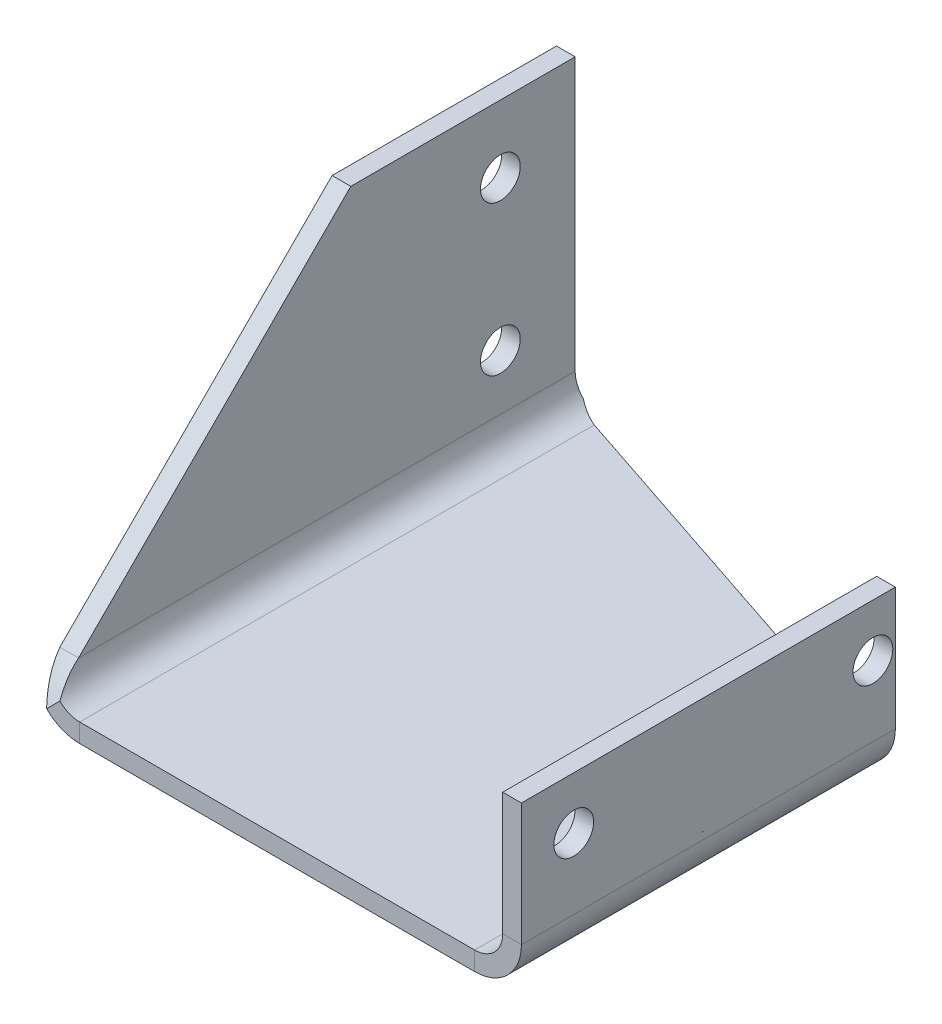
ISO-10303-21;
HEADER;
FILE_DESCRIPTION(('STEP AP214'),'2;1');
FILE_NAME('part.step','',(''),(''),'','','');
FILE_SCHEMA(('AUTOMOTIVE_DESIGN { 1 0 10303 214 1 1 1 1 }'));
ENDSEC;
DATA;
#1=APPLICATION_CONTEXT('core data for automotive mechanical design processes');
#2=APPLICATION_PROTOCOL_DEFINITION('international standard','automotive_design',2000,#1);
#3=PRODUCT_CONTEXT('',#1,'mechanical');
#4=PRODUCT('Part','Part','',(#3));
#5=PRODUCT_RELATED_PRODUCT_CATEGORY('part','',(#4));
#6=PRODUCT_DEFINITION_FORMATION('','',#4);
#7=PRODUCT_DEFINITION_CONTEXT('part definition',#1,'design');
#8=PRODUCT_DEFINITION('design','',#6,#7);
#9=PRODUCT_DEFINITION_SHAPE('','',#8);
#10=(LENGTH_UNIT() NAMED_UNIT(*) SI_UNIT(.MILLI.,.METRE.));
#11=(NAMED_UNIT(*) PLANE_ANGLE_UNIT() SI_UNIT($,.RADIAN.));
#12=(NAMED_UNIT(*) SI_UNIT($,.STERADIAN.) SOLID_ANGLE_UNIT());
#13=UNCERTAINTY_MEASURE_WITH_UNIT(LENGTH_MEASURE(1.E-05),#10,'distance_accuracy_value','');
#14=(GEOMETRIC_REPRESENTATION_CONTEXT(3) GLOBAL_UNCERTAINTY_ASSIGNED_CONTEXT((#13)) GLOBAL_UNIT_ASSIGNED_CONTEXT((#10,
#11,#12)) REPRESENTATION_CONTEXT('',''));
#15=CARTESIAN_POINT('',(0.,0.,0.));
#16=DIRECTION('',(0.,0.,1.));
#17=DIRECTION('',(1.,0.,0.));
#18=AXIS2_PLACEMENT_3D('',#15,#16,#17);
#19=CARTESIAN_POINT('',(47.4258596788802,50.99914032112,0.));
#20=DIRECTION('',(1.,0.,0.));
#21=DIRECTION('',(0.,0.,1.));
#22=AXIS2_PLACEMENT_3D('',#19,#20,#21);
#23=PLANE('',#22);
#24=CARTESIAN_POINT('',(47.4258596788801,14.16914032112,12.7));
#25=DIRECTION('',(-1.,0.,0.));
#26=DIRECTION('',(0.,0.,1.));
#27=AXIS2_PLACEMENT_3D('',#24,#25,#26);
#28=CIRCLE('',#27,3.37819999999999);
#29=CARTESIAN_POINT('',(47.4258596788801,14.16914032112,16.0782));
#30=VERTEX_POINT('',#29);
#31=EDGE_CURVE('E569',#30,#30,#28,.T.);
#32=ORIENTED_EDGE('',*,*,#31,.F.);
#33=EDGE_LOOP('',(#32));
#34=FACE_BOUND('',#33,.T.);
#35=DIRECTION('',(0.,0.,-1.));
#36=VECTOR('',#35,1.);
#37=CARTESIAN_POINT('',(47.42585967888,4.76250000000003,0.));
#38=LINE('',#37,#36);
#39=CARTESIAN_POINT('',(47.4258596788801,4.76250000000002,84.33664032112));
#40=VERTEX_POINT('',#39);
#41=CARTESIAN_POINT('',(47.42585967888,4.76250000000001,0.));
#42=VERTEX_POINT('',#41);
#43=EDGE_CURVE('E357',#40,#42,#38,.T.);
#44=ORIENTED_EDGE('',*,*,#43,.F.);
#45=DIRECTION('',(0.,-0.707106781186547,0.707106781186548));
#46=VECTOR('',#45,1.);
#47=CARTESIAN_POINT('',(47.4258596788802,50.99914032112,38.1));
#48=LINE('',#47,#46);
#49=CARTESIAN_POINT('',(47.4258596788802,50.99914032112,38.1));
#50=VERTEX_POINT('',#49);
#51=EDGE_CURVE('E353',#50,#40,#48,.T.);
#52=ORIENTED_EDGE('',*,*,#51,.F.);
#53=DIRECTION('',(0.,0.,1.));
#54=VECTOR('',#53,1.);
#55=CARTESIAN_POINT('',(47.4258596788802,50.99914032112,0.));
#56=LINE('',#55,#54);
#57=CARTESIAN_POINT('',(47.4258596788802,50.99914032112,0.));
#58=VERTEX_POINT('',#57);
#59=EDGE_CURVE('E354',#58,#50,#56,.T.);
#60=ORIENTED_EDGE('',*,*,#59,.F.);
#61=DIRECTION('',(0.,1.,0.));
#62=VECTOR('',#61,1.);
#63=CARTESIAN_POINT('',(47.42585967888,0.199140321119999,0.));
#64=LINE('',#63,#62);
#65=EDGE_CURVE('E341',#42,#58,#64,.T.);
#66=ORIENTED_EDGE('',*,*,#65,.F.);
#67=EDGE_LOOP('',(#44,#52,#60,#66));
#68=FACE_BOUND('',#67,.T.);
#69=CARTESIAN_POINT('',(47.4258596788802,39.56914032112,12.7));
#70=DIRECTION('',(-1.,0.,0.));
#71=DIRECTION('',(0.,0.,1.));
#72=AXIS2_PLACEMENT_3D('',#69,#70,#71);
#73=CIRCLE('',#72,3.37819999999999);
#74=CARTESIAN_POINT('',(47.4258596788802,39.56914032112,16.0782));
#75=VERTEX_POINT('',#74);
#76=EDGE_CURVE('E575',#75,#75,#73,.T.);
#77=ORIENTED_EDGE('',*,*,#76,.F.);
#78=EDGE_LOOP('',(#77));
#79=FACE_BOUND('',#78,.T.);
#80=ADVANCED_FACE('F73',(#34,#68,#79),#23,.F.);
#81=CARTESIAN_POINT('',(50.8,-3.175,0.));
#82=DIRECTION('',(0.316227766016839,0.,-0.948683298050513));
#83=DIRECTION('',(-0.948683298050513,0.,-0.316227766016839));
#84=AXIS2_PLACEMENT_3D('',#81,#82,#83);
#85=PLANE('',#84);
#86=DIRECTION('',(-0.948683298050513,0.,-0.316227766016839));
#87=VECTOR('',#86,1.);
#88=CARTESIAN_POINT('',(50.8,0.,0.));
#89=LINE('',#88,#87);
#90=CARTESIAN_POINT('',(122.43664032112,0.,23.8788801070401));
#91=VERTEX_POINT('',#90);
#92=CARTESIAN_POINT('',(55.36335967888,0.,1.52111989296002));
#93=VERTEX_POINT('',#92);
#94=EDGE_CURVE('E98',#91,#93,#89,.T.);
#95=ORIENTED_EDGE('',*,*,#94,.F.);
#96=CARTESIAN_POINT('',(122.43664032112,-3.175,23.8788801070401));
#97=CARTESIAN_POINT('',(122.43664032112,0.,23.8788801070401));
#98=B_SPLINE_CURVE_WITH_KNOTS('',1,(#96,#97),.UNSPECIFIED.,.F.,.F.,(2,2),(0.,1.),.UNSPECIFIED.);
#99=CARTESIAN_POINT('',(122.43664032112,-3.175,23.8788801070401));
#100=VERTEX_POINT('',#99);
#101=EDGE_CURVE('E328',#91,#100,#98,.F.);
#102=ORIENTED_EDGE('',*,*,#101,.T.);
#103=DIRECTION('',(-0.948683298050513,0.,-0.316227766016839));
#104=VECTOR('',#103,1.);
#105=CARTESIAN_POINT('',(50.8,-3.175,0.));
#106=LINE('',#105,#104);
#107=CARTESIAN_POINT('',(55.36335967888,-3.175,1.52111989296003));
#108=VERTEX_POINT('',#107);
#109=EDGE_CURVE('E501',#100,#108,#106,.T.);
#110=ORIENTED_EDGE('',*,*,#109,.T.);
#111=CARTESIAN_POINT('',(55.36335967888,0.,1.52111989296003));
#112=CARTESIAN_POINT('',(55.36335967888,-3.175,1.52111989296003));
#113=B_SPLINE_CURVE_WITH_KNOTS('',1,(#111,#112),.UNSPECIFIED.,.F.,.F.,(2,2),(0.,1.),.UNSPECIFIED.);
#114=EDGE_CURVE('E683',#93,#108,#113,.T.);
#115=ORIENTED_EDGE('',*,*,#114,.F.);
#116=EDGE_LOOP('',(#95,#102,#110,#115));
#117=FACE_BOUND('',#116,.T.);
#118=ADVANCED_FACE('F559',(#117),#85,.T.);
#119=CARTESIAN_POINT('',(152.4,-3.175,88.9));
#120=DIRECTION('',(0.,0.,1.));
#121=DIRECTION('',(1.,0.,0.));
#122=AXIS2_PLACEMENT_3D('',#119,#120,#121);
#123=PLANE('',#122);
#124=DIRECTION('',(1.,0.,0.));
#125=VECTOR('',#124,1.);
#126=CARTESIAN_POINT('',(50.8,-3.175,88.9));
#127=LINE('',#126,#125);
#128=CARTESIAN_POINT('',(55.36335967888,-3.175,88.9));
#129=VERTEX_POINT('',#128);
#130=CARTESIAN_POINT('',(122.43664032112,-3.17500000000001,88.9));
#131=VERTEX_POINT('',#130);
#132=EDGE_CURVE('E507',#129,#131,#127,.T.);
#133=ORIENTED_EDGE('',*,*,#132,.T.);
#134=DIRECTION('',(0.,1.,0.));
#135=VECTOR('',#134,1.);
#136=CARTESIAN_POINT('',(122.43664032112,-3.175,88.9));
#137=LINE('',#136,#135);
#138=CARTESIAN_POINT('',(122.43664032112,0.,88.9));
#139=VERTEX_POINT('',#138);
#140=EDGE_CURVE('E12',#131,#139,#137,.T.);
#141=ORIENTED_EDGE('',*,*,#140,.T.);
#142=DIRECTION('',(1.,0.,0.));
#143=VECTOR('',#142,1.);
#144=CARTESIAN_POINT('',(152.4,0.,88.9));
#145=LINE('',#144,#143);
#146=CARTESIAN_POINT('',(55.3633596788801,0.,88.9));
#147=VERTEX_POINT('',#146);
#148=EDGE_CURVE('E518',#147,#139,#145,.T.);
#149=ORIENTED_EDGE('',*,*,#148,.F.);
#150=DIRECTION('',(0.,1.,0.));
#151=VECTOR('',#150,1.);
#152=CARTESIAN_POINT('',(55.3633596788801,-3.175,88.9));
#153=LINE('',#152,#151);
#154=EDGE_CURVE('E490',#129,#147,#153,.T.);
#155=ORIENTED_EDGE('',*,*,#154,.F.);
#156=EDGE_LOOP('',(#133,#141,#149,#155));
#157=FACE_BOUND('',#156,.T.);
#158=ADVANCED_FACE('F75',(#157),#123,.T.);
#159=CARTESIAN_POINT('',(0.,0.,0.));
#160=DIRECTION('',(0.,1.,0.));
#161=DIRECTION('',(0.,0.,1.));
#162=AXIS2_PLACEMENT_3D('',#159,#160,#161);
#163=PLANE('',#162);
#164=ORIENTED_EDGE('',*,*,#148,.T.);
#165=DIRECTION('',(0.,0.,-1.));
#166=VECTOR('',#165,1.);
#167=CARTESIAN_POINT('',(122.43664032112,0.,0.));
#168=LINE('',#167,#166);
#169=EDGE_CURVE('E82',#139,#91,#168,.T.);
#170=ORIENTED_EDGE('',*,*,#169,.T.);
#171=ORIENTED_EDGE('',*,*,#94,.T.);
#172=DIRECTION('',(0.,0.,-1.));
#173=VECTOR('',#172,1.);
#174=CARTESIAN_POINT('',(55.36335967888,0.,0.));
#175=LINE('',#174,#173);
#176=EDGE_CURVE('E498',#147,#93,#175,.T.);
#177=ORIENTED_EDGE('',*,*,#176,.F.);
#178=EDGE_LOOP('',(#164,#170,#171,#177));
#179=FACE_BOUND('',#178,.T.);
#180=ADVANCED_FACE('F957',(#179),#163,.T.);
#181=CARTESIAN_POINT('',(0.,-3.175,0.));
#182=DIRECTION('',(0.,1.,0.));
#183=DIRECTION('',(0.,0.,1.));
#184=AXIS2_PLACEMENT_3D('',#181,#182,#183);
#185=PLANE('',#184);
#186=DIRECTION('',(0.,0.,-1.));
#187=VECTOR('',#186,1.);
#188=CARTESIAN_POINT('',(122.43664032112,-3.175,0.));
#189=LINE('',#188,#187);
#190=EDGE_CURVE('E681',#131,#100,#189,.T.);
#191=ORIENTED_EDGE('',*,*,#190,.F.);
#192=ORIENTED_EDGE('',*,*,#132,.F.);
#193=DIRECTION('',(0.,0.,-1.));
#194=VECTOR('',#193,1.);
#195=CARTESIAN_POINT('',(55.36335967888,-3.175,0.));
#196=LINE('',#195,#194);
#197=EDGE_CURVE('E499',#129,#108,#196,.T.);
#198=ORIENTED_EDGE('',*,*,#197,.T.);
#199=ORIENTED_EDGE('',*,*,#109,.F.);
#200=EDGE_LOOP('',(#191,#192,#198,#199));
#201=FACE_BOUND('',#200,.T.);
#202=ADVANCED_FACE('F448',(#201),#185,.F.);
#203=CARTESIAN_POINT('',(49.7506996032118,-0.850160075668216,88.9));
#204=CARTESIAN_POINT('',(49.0159178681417,-0.115378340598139,88.1393507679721));
#205=CARTESIAN_POINT('',(48.4276802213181,0.765024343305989,87.37888010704));
#206=CARTESIAN_POINT('',(47.6324515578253,2.68487616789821,85.85776021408));
#207=CARTESIAN_POINT('',(47.42585967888,3.72336170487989,85.0972895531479));
#208=CARTESIAN_POINT('',(47.42585967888,4.7625,84.33664032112));
#209=CARTESIAN_POINT('',(51.9957636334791,1.39490395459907,88.9));
#210=CARTESIAN_POINT('',(51.5549144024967,1.83575318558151,88.1393849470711));
#211=CARTESIAN_POINT('',(51.2019520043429,2.36401460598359,87.37888010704));
#212=CARTESIAN_POINT('',(50.7248148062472,3.51592570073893,85.85776021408));
#213=CARTESIAN_POINT('',(50.60085967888,4.13904503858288,85.0972553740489));
#214=CARTESIAN_POINT('',(50.60085967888,4.7625,84.33664032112));
#215=B_SPLINE_SURFACE_WITH_KNOTS('',1,3,((#203,#204,#205,#206,#207,#208),(#209,#210,#211,#212,
#213,#214)),.UNSPECIFIED.,.F.,.F.,.F.,(2,2),(4,2,4),(0.,1.),(0.,0.5,1.),.UNSPECIFIED.);
#216=CARTESIAN_POINT('',(49.7506996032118,-0.850160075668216,88.9));
#217=CARTESIAN_POINT('',(51.9957636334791,1.39490395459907,88.9));
#218=B_SPLINE_CURVE_WITH_KNOTS('',1,(#216,#217),.UNSPECIFIED.,.F.,.F.,(2,2),(0.,1.),.UNSPECIFIED.);
#219=CARTESIAN_POINT('',(51.9957636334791,1.39490395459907,88.9));
#220=VERTEX_POINT('',#219);
#221=CARTESIAN_POINT('',(49.7506996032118,-0.850160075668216,88.9));
#222=VERTEX_POINT('',#221);
#223=EDGE_CURVE('E478',#220,#222,#218,.F.);
#224=CARTESIAN_POINT('',(51.9957636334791,1.39490395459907,88.9));
#225=CARTESIAN_POINT('',(51.5549144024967,1.83575318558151,88.1393849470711));
#226=CARTESIAN_POINT('',(51.2019520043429,2.36401460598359,87.37888010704));
#227=CARTESIAN_POINT('',(50.7248148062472,3.51592570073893,85.85776021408));
#228=CARTESIAN_POINT('',(50.60085967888,4.13904503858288,85.0972553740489));
#229=CARTESIAN_POINT('',(50.60085967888,4.7625,84.33664032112));
#230=B_SPLINE_CURVE_WITH_KNOTS('',3,(#224,#225,#226,#227,#228,#229),.UNSPECIFIED.,.F.,.F.,(4,2,
4),(0.,0.5,1.),.UNSPECIFIED.);
#231=CARTESIAN_POINT('',(50.6008596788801,4.7625,84.33664032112));
#232=VERTEX_POINT('',#231);
#233=EDGE_CURVE('E340',#220,#232,#230,.T.);
#234=CARTESIAN_POINT('',(50.60085967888,4.7625,84.33664032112));
#235=CARTESIAN_POINT('',(47.42585967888,4.7625,84.33664032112));
#236=B_SPLINE_CURVE_WITH_KNOTS('',1,(#234,#235),.UNSPECIFIED.,.F.,.F.,(2,2),(0.,1.),.UNSPECIFIED.);
#237=EDGE_CURVE('E526',#40,#232,#236,.F.);
#238=CARTESIAN_POINT('',(47.42585967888,4.7625,84.33664032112));
#239=CARTESIAN_POINT('',(47.42585967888,3.72336170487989,85.0972895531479));
#240=CARTESIAN_POINT('',(47.6324515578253,2.68487616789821,85.85776021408));
#241=CARTESIAN_POINT('',(48.4276802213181,0.765024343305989,87.37888010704));
#242=CARTESIAN_POINT('',(49.0159178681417,-0.115378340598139,88.1393507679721));
#243=CARTESIAN_POINT('',(49.7506996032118,-0.850160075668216,88.9));
#244=B_SPLINE_CURVE_WITH_KNOTS('',3,(#238,#239,#240,#241,#242,#243),.UNSPECIFIED.,.F.,.F.,(4,2,
4),(0.,0.5,1.),.UNSPECIFIED.);
#245=EDGE_CURVE('E400',#222,#40,#244,.F.);
#246=ORIENTED_EDGE('',*,*,#223,.F.);
#247=ORIENTED_EDGE('',*,*,#233,.T.);
#248=ORIENTED_EDGE('',*,*,#237,.F.);
#249=ORIENTED_EDGE('',*,*,#245,.F.);
#250=EDGE_LOOP('',(#246,#247,#248,#249));
#251=FACE_BOUND('',#250,.T.);
#252=ADVANCED_FACE('F435',(#251),#215,.T.);
#253=CARTESIAN_POINT('',(55.36335967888,4.7625,0.));
#254=DIRECTION('',(0.,0.,-1.));
#255=DIRECTION('',(-1.,0.,0.));
#256=AXIS2_PLACEMENT_3D('',#253,#254,#255);
#257=PLANE('',#256);
#258=DIRECTION('',(-1.,0.,0.));
#259=VECTOR('',#258,1.);
#260=CARTESIAN_POINT('',(47.42585967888,4.76250000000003,0.));
#261=LINE('',#260,#259);
#262=CARTESIAN_POINT('',(50.60085967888,4.76250000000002,0.));
#263=VERTEX_POINT('',#262);
#264=EDGE_CURVE('E343',#263,#42,#261,.T.);
#265=ORIENTED_EDGE('',*,*,#264,.F.);
#266=CARTESIAN_POINT('',(55.36335967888,4.7625,0.));
#267=DIRECTION('',(0.,0.,-1.));
#268=DIRECTION('',(-1.,0.,0.));
#269=AXIS2_PLACEMENT_3D('',#266,#267,#268);
#270=CIRCLE('',#269,4.7625);
#271=CARTESIAN_POINT('',(51.9957636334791,1.39490395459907,0.));
#272=VERTEX_POINT('',#271);
#273=EDGE_CURVE('E621',#263,#272,#270,.F.);
#274=ORIENTED_EDGE('',*,*,#273,.T.);
#275=CARTESIAN_POINT('',(49.7506996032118,-0.850160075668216,0.));
#276=CARTESIAN_POINT('',(51.9957636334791,1.39490395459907,0.));
#277=B_SPLINE_CURVE_WITH_KNOTS('',1,(#275,#276),.UNSPECIFIED.,.F.,.F.,(2,2),(0.,1.),.UNSPECIFIED.);
#278=CARTESIAN_POINT('',(49.7506996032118,-0.850160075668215,0.));
#279=VERTEX_POINT('',#278);
#280=EDGE_CURVE('E403',#272,#279,#277,.F.);
#281=ORIENTED_EDGE('',*,*,#280,.T.);
#282=CARTESIAN_POINT('',(55.36335967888,4.7625,0.));
#283=DIRECTION('',(0.,0.,1.));
#284=DIRECTION('',(-1.,0.,0.));
#285=AXIS2_PLACEMENT_3D('',#282,#283,#284);
#286=CIRCLE('',#285,7.9375);
#287=EDGE_CURVE('E604',#42,#279,#286,.T.);
#288=ORIENTED_EDGE('',*,*,#287,.F.);
#289=EDGE_LOOP('',(#265,#274,#281,#288));
#290=FACE_BOUND('',#289,.T.);
#291=ADVANCED_FACE('F447',(#290),#257,.T.);
#292=CARTESIAN_POINT('',(49.7506996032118,-0.850160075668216,0.));
#293=CARTESIAN_POINT('',(50.4855201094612,-1.58498058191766,0.253563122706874));
#294=CARTESIAN_POINT('',(51.365884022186,-2.17317945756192,0.50703996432));
#295=CARTESIAN_POINT('',(53.2857358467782,-2.96840812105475,1.01407992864));
#296=CARTESIAN_POINT('',(54.3241665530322,-3.175,1.26755677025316));
#297=CARTESIAN_POINT('',(55.36335967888,-3.175,1.52111989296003));
#298=CARTESIAN_POINT('',(51.9957636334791,1.39490395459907,0.));
#299=CARTESIAN_POINT('',(52.4366491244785,0.954018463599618,0.253559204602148));
#300=CARTESIAN_POINT('',(52.9648742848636,0.601092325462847,0.50703996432));
#301=CARTESIAN_POINT('',(54.116785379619,0.123955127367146,1.01407992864));
#302=CARTESIAN_POINT('',(54.7398534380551,0.,1.2675606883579));
#303=CARTESIAN_POINT('',(55.36335967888,0.,1.52111989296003));
#304=B_SPLINE_SURFACE_WITH_KNOTS('',1,3,((#292,#293,#294,#295,#296,#297),(#298,#299,#300,#301,
#302,#303)),.UNSPECIFIED.,.F.,.F.,.F.,(2,2),(4,2,4),(0.,1.),(0.,0.5,1.),.UNSPECIFIED.);
#305=CARTESIAN_POINT('',(51.9957636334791,1.39490395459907,0.));
#306=CARTESIAN_POINT('',(52.4366491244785,0.954018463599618,0.253559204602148));
#307=CARTESIAN_POINT('',(52.9648742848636,0.601092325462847,0.50703996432));
#308=CARTESIAN_POINT('',(54.116785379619,0.123955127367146,1.01407992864));
#309=CARTESIAN_POINT('',(54.7398534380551,0.,1.2675606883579));
#310=CARTESIAN_POINT('',(55.36335967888,0.,1.52111989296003));
#311=B_SPLINE_CURVE_WITH_KNOTS('',3,(#305,#306,#307,#308,#309,#310),.UNSPECIFIED.,.F.,.F.,(4,2,
4),(0.,0.5,1.),.UNSPECIFIED.);
#312=EDGE_CURVE('E424',#272,#93,#311,.T.);
#313=CARTESIAN_POINT('',(55.36335967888,-3.175,1.52111989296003));
#314=CARTESIAN_POINT('',(54.3241665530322,-3.175,1.26755677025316));
#315=CARTESIAN_POINT('',(53.2857358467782,-2.96840812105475,1.01407992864));
#316=CARTESIAN_POINT('',(51.365884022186,-2.17317945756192,0.50703996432));
#317=CARTESIAN_POINT('',(50.4855201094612,-1.58498058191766,0.253563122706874));
#318=CARTESIAN_POINT('',(49.7506996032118,-0.850160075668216,0.));
#319=B_SPLINE_CURVE_WITH_KNOTS('',3,(#313,#314,#315,#316,#317,#318),.UNSPECIFIED.,.F.,.F.,(4,2,
4),(0.,0.5,1.),.UNSPECIFIED.);
#320=EDGE_CURVE('E404',#279,#108,#319,.F.);
#321=ORIENTED_EDGE('',*,*,#280,.F.);
#322=ORIENTED_EDGE('',*,*,#312,.T.);
#323=ORIENTED_EDGE('',*,*,#114,.T.);
#324=ORIENTED_EDGE('',*,*,#320,.F.);
#325=EDGE_LOOP('',(#321,#322,#323,#324));
#326=FACE_BOUND('',#325,.T.);
#327=ADVANCED_FACE('F635',(#326),#304,.T.);
#328=CARTESIAN_POINT('',(55.36335967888,4.7625,88.9));
#329=DIRECTION('',(0.,0.,1.));
#330=DIRECTION('',(1.,0.,0.));
#331=AXIS2_PLACEMENT_3D('',#328,#329,#330);
#332=PLANE('',#331);
#333=CARTESIAN_POINT('',(55.36335967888,4.7625,88.9));
#334=DIRECTION('',(0.,0.,-1.));
#335=DIRECTION('',(-1.,0.,0.));
#336=AXIS2_PLACEMENT_3D('',#333,#334,#335);
#337=CIRCLE('',#336,4.7625);
#338=EDGE_CURVE('E417',#147,#220,#337,.T.);
#339=ORIENTED_EDGE('',*,*,#338,.T.);
#340=ORIENTED_EDGE('',*,*,#223,.T.);
#341=CARTESIAN_POINT('',(55.36335967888,4.7625,88.9));
#342=DIRECTION('',(0.,0.,-1.));
#343=DIRECTION('',(1.,0.,0.));
#344=AXIS2_PLACEMENT_3D('',#341,#342,#343);
#345=CIRCLE('',#344,7.9375);
#346=EDGE_CURVE('E401',#129,#222,#345,.T.);
#347=ORIENTED_EDGE('',*,*,#346,.F.);
#348=ORIENTED_EDGE('',*,*,#154,.T.);
#349=EDGE_LOOP('',(#339,#340,#347,#348));
#350=FACE_BOUND('',#349,.T.);
#351=ADVANCED_FACE('F375',(#350),#332,.T.);
#352=CARTESIAN_POINT('',(55.3633596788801,4.7625,134.634201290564));
#353=DIRECTION('',(0.,0.,-1.));
#354=DIRECTION('',(-1.,0.,0.));
#355=AXIS2_PLACEMENT_3D('',#352,#353,#354);
#356=CYLINDRICAL_SURFACE('',#355,7.9375);
#357=ORIENTED_EDGE('',*,*,#197,.F.);
#358=ORIENTED_EDGE('',*,*,#346,.T.);
#359=ORIENTED_EDGE('',*,*,#245,.T.);
#360=ORIENTED_EDGE('',*,*,#43,.T.);
#361=ORIENTED_EDGE('',*,*,#287,.T.);
#362=ORIENTED_EDGE('',*,*,#320,.T.);
#363=EDGE_LOOP('',(#357,#358,#359,#360,#361,#362));
#364=FACE_BOUND('',#363,.T.);
#365=ADVANCED_FACE('F364',(#364),#356,.T.);
#366=CARTESIAN_POINT('',(55.3633596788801,4.7625,134.634201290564));
#367=DIRECTION('',(0.,0.,-1.));
#368=DIRECTION('',(-1.,0.,0.));
#369=AXIS2_PLACEMENT_3D('',#366,#367,#368);
#370=CYLINDRICAL_SURFACE('',#369,4.7625);
#371=ORIENTED_EDGE('',*,*,#176,.T.);
#372=ORIENTED_EDGE('',*,*,#312,.F.);
#373=ORIENTED_EDGE('',*,*,#273,.F.);
#374=DIRECTION('',(0.,0.,-1.));
#375=VECTOR('',#374,1.);
#376=CARTESIAN_POINT('',(50.60085967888,4.76250000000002,0.));
#377=LINE('',#376,#375);
#378=EDGE_CURVE('E350',#232,#263,#377,.T.);
#379=ORIENTED_EDGE('',*,*,#378,.F.);
#380=ORIENTED_EDGE('',*,*,#233,.F.);
#381=ORIENTED_EDGE('',*,*,#338,.F.);
#382=EDGE_LOOP('',(#371,#372,#373,#379,#380,#381));
#383=FACE_BOUND('',#382,.T.);
#384=ADVANCED_FACE('F374',(#383),#370,.F.);
#385=CARTESIAN_POINT('',(47.4258596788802,50.99914032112,0.));
#386=DIRECTION('',(0.,1.,0.));
#387=DIRECTION('',(0.,0.,1.));
#388=AXIS2_PLACEMENT_3D('',#385,#386,#387);
#389=PLANE('',#388);
#390=DIRECTION('',(0.,0.,1.));
#391=VECTOR('',#390,1.);
#392=CARTESIAN_POINT('',(50.6008596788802,50.99914032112,0.));
#393=LINE('',#392,#391);
#394=CARTESIAN_POINT('',(50.6008596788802,50.99914032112,0.));
#395=VERTEX_POINT('',#394);
#396=CARTESIAN_POINT('',(50.6008596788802,50.99914032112,38.1));
#397=VERTEX_POINT('',#396);
#398=EDGE_CURVE('E345',#395,#397,#393,.T.);
#399=ORIENTED_EDGE('',*,*,#398,.F.);
#400=DIRECTION('',(1.,0.,0.));
#401=VECTOR('',#400,1.);
#402=CARTESIAN_POINT('',(47.4258596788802,50.99914032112,0.));
#403=LINE('',#402,#401);
#404=EDGE_CURVE('E332',#58,#395,#403,.T.);
#405=ORIENTED_EDGE('',*,*,#404,.F.);
#406=ORIENTED_EDGE('',*,*,#59,.T.);
#407=DIRECTION('',(1.,0.,0.));
#408=VECTOR('',#407,1.);
#409=CARTESIAN_POINT('',(47.4258596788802,50.99914032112,38.1));
#410=LINE('',#409,#408);
#411=EDGE_CURVE('E351',#50,#397,#410,.T.);
#412=ORIENTED_EDGE('',*,*,#411,.T.);
#413=EDGE_LOOP('',(#399,#405,#406,#412));
#414=FACE_BOUND('',#413,.T.);
#415=ADVANCED_FACE('F548',(#414),#389,.T.);
#416=CARTESIAN_POINT('',(47.4258596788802,50.99914032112,38.1));
#417=DIRECTION('',(0.,0.707106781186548,0.707106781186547));
#418=DIRECTION('',(0.,-0.707106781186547,0.707106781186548));
#419=AXIS2_PLACEMENT_3D('',#416,#417,#418);
#420=PLANE('',#419);
#421=ORIENTED_EDGE('',*,*,#51,.T.);
#422=ORIENTED_EDGE('',*,*,#237,.T.);
#423=DIRECTION('',(0.,-0.707106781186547,0.707106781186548));
#424=VECTOR('',#423,1.);
#425=CARTESIAN_POINT('',(50.6008596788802,50.99914032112,38.1));
#426=LINE('',#425,#424);
#427=EDGE_CURVE('E721',#397,#232,#426,.T.);
#428=ORIENTED_EDGE('',*,*,#427,.F.);
#429=ORIENTED_EDGE('',*,*,#411,.F.);
#430=EDGE_LOOP('',(#421,#422,#428,#429));
#431=FACE_BOUND('',#430,.T.);
#432=ADVANCED_FACE('F538',(#431),#420,.T.);
#433=CARTESIAN_POINT('',(50.6008596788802,50.99914032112,0.));
#434=DIRECTION('',(1.,0.,0.));
#435=DIRECTION('',(0.,0.,1.));
#436=AXIS2_PLACEMENT_3D('',#433,#434,#435);
#437=PLANE('',#436);
#438=CARTESIAN_POINT('',(50.6008596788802,39.56914032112,12.7));
#439=DIRECTION('',(1.,0.,0.));
#440=DIRECTION('',(0.,1.,0.));
#441=AXIS2_PLACEMENT_3D('',#438,#439,#440);
#442=CIRCLE('',#441,3.37819999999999);
#443=CARTESIAN_POINT('',(50.6008596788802,42.94734032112,12.7));
#444=VERTEX_POINT('',#443);
#445=EDGE_CURVE('E577',#444,#444,#442,.T.);
#446=ORIENTED_EDGE('',*,*,#445,.F.);
#447=EDGE_LOOP('',(#446));
#448=FACE_BOUND('',#447,.T.);
#449=CARTESIAN_POINT('',(50.6008596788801,14.16914032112,12.7));
#450=DIRECTION('',(1.,0.,0.));
#451=DIRECTION('',(0.,1.,0.));
#452=AXIS2_PLACEMENT_3D('',#449,#450,#451);
#453=CIRCLE('',#452,3.37819999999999);
#454=CARTESIAN_POINT('',(50.6008596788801,17.54734032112,12.7));
#455=VERTEX_POINT('',#454);
#456=EDGE_CURVE('E220',#455,#455,#453,.T.);
#457=ORIENTED_EDGE('',*,*,#456,.F.);
#458=EDGE_LOOP('',(#457));
#459=FACE_BOUND('',#458,.T.);
#460=ORIENTED_EDGE('',*,*,#427,.T.);
#461=ORIENTED_EDGE('',*,*,#378,.T.);
#462=DIRECTION('',(0.,1.,0.));
#463=VECTOR('',#462,1.);
#464=CARTESIAN_POINT('',(50.60085967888,0.199140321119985,0.));
#465=LINE('',#464,#463);
#466=EDGE_CURVE('E348',#263,#395,#465,.T.);
#467=ORIENTED_EDGE('',*,*,#466,.T.);
#468=ORIENTED_EDGE('',*,*,#398,.T.);
#469=EDGE_LOOP('',(#460,#461,#467,#468));
#470=FACE_BOUND('',#469,.T.);
#471=ADVANCED_FACE('F547',(#448,#459,#470),#437,.T.);
#472=CARTESIAN_POINT('',(47.42585967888,0.199140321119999,0.));
#473=DIRECTION('',(0.,0.,-1.));
#474=DIRECTION('',(0.,1.,0.));
#475=AXIS2_PLACEMENT_3D('',#472,#473,#474);
#476=PLANE('',#475);
#477=ORIENTED_EDGE('',*,*,#466,.F.);
#478=ORIENTED_EDGE('',*,*,#264,.T.);
#479=ORIENTED_EDGE('',*,*,#65,.T.);
#480=ORIENTED_EDGE('',*,*,#404,.T.);
#481=EDGE_LOOP('',(#477,#478,#479,#480));
#482=FACE_BOUND('',#481,.T.);
#483=ADVANCED_FACE('F377',(#482),#476,.T.);
#484=CARTESIAN_POINT('',(122.43664032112,4.7625,88.9));
#485=DIRECTION('',(0.,0.,1.));
#486=DIRECTION('',(1.,0.,0.));
#487=AXIS2_PLACEMENT_3D('',#484,#485,#486);
#488=PLANE('',#487);
#489=DIRECTION('',(-1.,0.,0.));
#490=VECTOR('',#489,1.);
#491=CARTESIAN_POINT('',(130.37414032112,4.76250000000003,88.9));
#492=LINE('',#491,#490);
#493=CARTESIAN_POINT('',(130.37414032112,4.76250000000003,88.9));
#494=VERTEX_POINT('',#493);
#495=CARTESIAN_POINT('',(127.19914032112,4.76250000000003,88.9));
#496=VERTEX_POINT('',#495);
#497=EDGE_CURVE('E190',#494,#496,#492,.T.);
#498=ORIENTED_EDGE('',*,*,#497,.T.);
#499=CARTESIAN_POINT('',(122.43664032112,4.7625,88.9));
#500=DIRECTION('',(0.,0.,1.));
#501=DIRECTION('',(1.,0.,0.));
#502=AXIS2_PLACEMENT_3D('',#499,#500,#501);
#503=CIRCLE('',#502,4.7625);
#504=EDGE_CURVE('E90',#496,#139,#503,.F.);
#505=ORIENTED_EDGE('',*,*,#504,.T.);
#506=ORIENTED_EDGE('',*,*,#140,.F.);
#507=CARTESIAN_POINT('',(122.43664032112,4.7625,88.9));
#508=DIRECTION('',(0.,0.,-1.));
#509=DIRECTION('',(1.,0.,0.));
#510=AXIS2_PLACEMENT_3D('',#507,#508,#509);
#511=CIRCLE('',#510,7.93750000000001);
#512=EDGE_CURVE('E221',#494,#131,#511,.T.);
#513=ORIENTED_EDGE('',*,*,#512,.F.);
#514=EDGE_LOOP('',(#498,#505,#506,#513));
#515=FACE_BOUND('',#514,.T.);
#516=ADVANCED_FACE('F291',(#515),#488,.T.);
#517=CARTESIAN_POINT('',(122.43664032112,-3.175,23.8788801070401));
#518=CARTESIAN_POINT('',(123.475833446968,-3.175,24.132443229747));
#519=CARTESIAN_POINT('',(124.514264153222,-2.96840812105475,24.3859200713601));
#520=CARTESIAN_POINT('',(126.434115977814,-2.17317945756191,24.8929600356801));
#521=CARTESIAN_POINT('',(127.314479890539,-1.58498058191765,25.1464368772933));
#522=CARTESIAN_POINT('',(128.049300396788,-0.850160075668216,25.4000000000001));
#523=CARTESIAN_POINT('',(122.43664032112,0.,23.8788801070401));
#524=CARTESIAN_POINT('',(123.060146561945,0.,24.1324393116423));
#525=CARTESIAN_POINT('',(123.683214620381,0.12395512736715,24.3859200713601));
#526=CARTESIAN_POINT('',(124.835125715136,0.601092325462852,24.8929600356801));
#527=CARTESIAN_POINT('',(125.363350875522,0.954018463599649,25.146440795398));
#528=CARTESIAN_POINT('',(125.804236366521,1.39490395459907,25.4000000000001));
#529=B_SPLINE_SURFACE_WITH_KNOTS('',1,3,((#517,#518,#519,#520,#521,#522),(#523,#524,#525,#526,
#527,#528)),.UNSPECIFIED.,.F.,.F.,.F.,(2,2),(4,2,4),(0.,1.),(0.,0.5,1.),.UNSPECIFIED.);
#530=CARTESIAN_POINT('',(122.43664032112,0.,23.8788801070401));
#531=CARTESIAN_POINT('',(123.060146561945,0.,24.1324393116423));
#532=CARTESIAN_POINT('',(123.683214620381,0.12395512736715,24.3859200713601));
#533=CARTESIAN_POINT('',(124.835125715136,0.601092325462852,24.8929600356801));
#534=CARTESIAN_POINT('',(125.363350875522,0.954018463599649,25.146440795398));
#535=CARTESIAN_POINT('',(125.804236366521,1.39490395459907,25.4000000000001));
#536=B_SPLINE_CURVE_WITH_KNOTS('',3,(#530,#531,#532,#533,#534,#535),.UNSPECIFIED.,.F.,.F.,(4,2,
4),(0.,0.5,1.),.UNSPECIFIED.);
#537=CARTESIAN_POINT('',(125.804236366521,1.39490395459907,25.4000000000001));
#538=VERTEX_POINT('',#537);
#539=EDGE_CURVE('E227',#91,#538,#536,.T.);
#540=CARTESIAN_POINT('',(125.804236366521,1.39490395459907,25.4000000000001));
#541=CARTESIAN_POINT('',(128.049300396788,-0.850160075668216,25.4000000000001));
#542=B_SPLINE_CURVE_WITH_KNOTS('',1,(#540,#541),.UNSPECIFIED.,.F.,.F.,(2,2),(0.,1.),.UNSPECIFIED.);
#543=CARTESIAN_POINT('',(128.049300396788,-0.850160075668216,25.4000000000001));
#544=VERTEX_POINT('',#543);
#545=EDGE_CURVE('E317',#538,#544,#542,.T.);
#546=CARTESIAN_POINT('',(128.049300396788,-0.850160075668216,25.4000000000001));
#547=CARTESIAN_POINT('',(127.314479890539,-1.58498058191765,25.1464368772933));
#548=CARTESIAN_POINT('',(126.434115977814,-2.17317945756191,24.8929600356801));
#549=CARTESIAN_POINT('',(124.514264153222,-2.96840812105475,24.3859200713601));
#550=CARTESIAN_POINT('',(123.475833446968,-3.175,24.132443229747));
#551=CARTESIAN_POINT('',(122.43664032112,-3.175,23.8788801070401));
#552=B_SPLINE_CURVE_WITH_KNOTS('',3,(#546,#547,#548,#549,#550,#551),.UNSPECIFIED.,.F.,.F.,(4,2,
4),(0.,0.5,1.),.UNSPECIFIED.);
#553=EDGE_CURVE('E224',#100,#544,#552,.F.);
#554=ORIENTED_EDGE('',*,*,#101,.F.);
#555=ORIENTED_EDGE('',*,*,#539,.T.);
#556=ORIENTED_EDGE('',*,*,#545,.T.);
#557=ORIENTED_EDGE('',*,*,#553,.F.);
#558=EDGE_LOOP('',(#554,#555,#556,#557));
#559=FACE_BOUND('',#558,.T.);
#560=ADVANCED_FACE('F280',(#559),#529,.T.);
#561=CARTESIAN_POINT('',(122.43664032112,4.7625,25.4000000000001));
#562=DIRECTION('',(0.,0.,-1.));
#563=DIRECTION('',(-1.,0.,0.));
#564=AXIS2_PLACEMENT_3D('',#561,#562,#563);
#565=PLANE('',#564);
#566=ORIENTED_EDGE('',*,*,#545,.F.);
#567=CARTESIAN_POINT('',(122.43664032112,4.7625,25.4000000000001));
#568=DIRECTION('',(0.,0.,1.));
#569=DIRECTION('',(1.,0.,0.));
#570=AXIS2_PLACEMENT_3D('',#567,#568,#569);
#571=CIRCLE('',#570,4.7625);
#572=CARTESIAN_POINT('',(127.19914032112,4.7625,25.4000000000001));
#573=VERTEX_POINT('',#572);
#574=EDGE_CURVE('E225',#538,#573,#571,.T.);
#575=ORIENTED_EDGE('',*,*,#574,.T.);
#576=DIRECTION('',(1.,0.,0.));
#577=VECTOR('',#576,1.);
#578=CARTESIAN_POINT('',(130.37414032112,4.76250000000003,25.4000000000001));
#579=LINE('',#578,#577);
#580=CARTESIAN_POINT('',(130.37414032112,4.7625,25.4000000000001));
#581=VERTEX_POINT('',#580);
#582=EDGE_CURVE('E208',#573,#581,#579,.T.);
#583=ORIENTED_EDGE('',*,*,#582,.T.);
#584=CARTESIAN_POINT('',(122.43664032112,4.7625,25.4000000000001));
#585=DIRECTION('',(0.,0.,1.));
#586=DIRECTION('',(-1.,0.,0.));
#587=AXIS2_PLACEMENT_3D('',#584,#585,#586);
#588=CIRCLE('',#587,7.9375);
#589=EDGE_CURVE('E236',#544,#581,#588,.T.);
#590=ORIENTED_EDGE('',*,*,#589,.F.);
#591=EDGE_LOOP('',(#566,#575,#583,#590));
#592=FACE_BOUND('',#591,.T.);
#593=ADVANCED_FACE('F250',(#592),#565,.T.);
#594=CARTESIAN_POINT('',(122.43664032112,4.7625,-9.34581428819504));
#595=DIRECTION('',(0.,0.,1.));
#596=DIRECTION('',(1.,0.,0.));
#597=AXIS2_PLACEMENT_3D('',#594,#595,#596);
#598=CYLINDRICAL_SURFACE('',#597,7.9375);
#599=ORIENTED_EDGE('',*,*,#589,.T.);
#600=DIRECTION('',(0.,0.,-1.));
#601=VECTOR('',#600,1.);
#602=CARTESIAN_POINT('',(130.37414032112,4.7625,0.));
#603=LINE('',#602,#601);
#604=EDGE_CURVE('E210',#494,#581,#603,.T.);
#605=ORIENTED_EDGE('',*,*,#604,.F.);
#606=ORIENTED_EDGE('',*,*,#512,.T.);
#607=ORIENTED_EDGE('',*,*,#190,.T.);
#608=ORIENTED_EDGE('',*,*,#553,.T.);
#609=EDGE_LOOP('',(#599,#605,#606,#607,#608));
#610=FACE_BOUND('',#609,.T.);
#611=ADVANCED_FACE('F239',(#610),#598,.T.);
#612=CARTESIAN_POINT('',(122.43664032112,4.7625,-9.34581428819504));
#613=DIRECTION('',(0.,0.,1.));
#614=DIRECTION('',(1.,0.,0.));
#615=AXIS2_PLACEMENT_3D('',#612,#613,#614);
#616=CYLINDRICAL_SURFACE('',#615,4.7625);
#617=ORIENTED_EDGE('',*,*,#574,.F.);
#618=ORIENTED_EDGE('',*,*,#539,.F.);
#619=ORIENTED_EDGE('',*,*,#169,.F.);
#620=ORIENTED_EDGE('',*,*,#504,.F.);
#621=DIRECTION('',(0.,0.,-1.));
#622=VECTOR('',#621,1.);
#623=CARTESIAN_POINT('',(127.19914032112,4.7625,0.));
#624=LINE('',#623,#622);
#625=EDGE_CURVE('E213',#496,#573,#624,.T.);
#626=ORIENTED_EDGE('',*,*,#625,.T.);
#627=EDGE_LOOP('',(#617,#618,#619,#620,#626));
#628=FACE_BOUND('',#627,.T.);
#629=ADVANCED_FACE('F249',(#628),#616,.F.);
#630=CARTESIAN_POINT('',(130.37414032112,25.59914032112,25.4000000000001));
#631=DIRECTION('',(0.,1.,0.));
#632=DIRECTION('',(0.,0.,-1.));
#633=AXIS2_PLACEMENT_3D('',#630,#631,#632);
#634=PLANE('',#633);
#635=DIRECTION('',(0.,0.,-1.));
#636=VECTOR('',#635,1.);
#637=CARTESIAN_POINT('',(127.19914032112,25.59914032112,25.4000000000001));
#638=LINE('',#637,#636);
#639=CARTESIAN_POINT('',(127.19914032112,25.59914032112,88.9));
#640=VERTEX_POINT('',#639);
#641=CARTESIAN_POINT('',(127.19914032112,25.59914032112,25.4000000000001));
#642=VERTEX_POINT('',#641);
#643=EDGE_CURVE('E202',#640,#642,#638,.T.);
#644=ORIENTED_EDGE('',*,*,#643,.F.);
#645=DIRECTION('',(-1.,0.,0.));
#646=VECTOR('',#645,1.);
#647=CARTESIAN_POINT('',(130.37414032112,25.59914032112,88.9));
#648=LINE('',#647,#646);
#649=CARTESIAN_POINT('',(130.37414032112,25.59914032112,88.9));
#650=VERTEX_POINT('',#649);
#651=EDGE_CURVE('E188',#650,#640,#648,.T.);
#652=ORIENTED_EDGE('',*,*,#651,.F.);
#653=DIRECTION('',(0.,0.,-1.));
#654=VECTOR('',#653,1.);
#655=CARTESIAN_POINT('',(130.37414032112,25.59914032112,25.4000000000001));
#656=LINE('',#655,#654);
#657=CARTESIAN_POINT('',(130.37414032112,25.59914032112,25.4000000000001));
#658=VERTEX_POINT('',#657);
#659=EDGE_CURVE('E200',#650,#658,#656,.T.);
#660=ORIENTED_EDGE('',*,*,#659,.T.);
#661=DIRECTION('',(-1.,0.,0.));
#662=VECTOR('',#661,1.);
#663=CARTESIAN_POINT('',(130.37414032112,25.59914032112,25.4000000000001));
#664=LINE('',#663,#662);
#665=EDGE_CURVE('E207',#658,#642,#664,.T.);
#666=ORIENTED_EDGE('',*,*,#665,.T.);
#667=EDGE_LOOP('',(#644,#652,#660,#666));
#668=FACE_BOUND('',#667,.T.);
#669=ADVANCED_FACE('F199',(#668),#634,.T.);
#670=CARTESIAN_POINT('',(130.374140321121,-126.80085967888,0.));
#671=DIRECTION('',(-1.,0.,0.));
#672=DIRECTION('',(0.,0.,1.));
#673=AXIS2_PLACEMENT_3D('',#670,#671,#672);
#674=PLANE('',#673);
#675=CARTESIAN_POINT('',(130.37414032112,16.70914032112,80.01));
#676=DIRECTION('',(1.,0.,0.));
#677=DIRECTION('',(0.,0.,-1.));
#678=AXIS2_PLACEMENT_3D('',#675,#676,#677);
#679=CIRCLE('',#678,3.37819999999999);
#680=CARTESIAN_POINT('',(130.37414032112,16.70914032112,76.6318));
#681=VERTEX_POINT('',#680);
#682=EDGE_CURVE('E987',#681,#681,#679,.T.);
#683=ORIENTED_EDGE('',*,*,#682,.F.);
#684=EDGE_LOOP('',(#683));
#685=FACE_BOUND('',#684,.T.);
#686=CARTESIAN_POINT('',(130.37414032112,16.7091403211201,29.21));
#687=DIRECTION('',(1.,0.,0.));
#688=DIRECTION('',(0.,0.,-1.));
#689=AXIS2_PLACEMENT_3D('',#686,#687,#688);
#690=CIRCLE('',#689,3.37819999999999);
#691=CARTESIAN_POINT('',(130.37414032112,16.7091403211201,25.8318));
#692=VERTEX_POINT('',#691);
#693=EDGE_CURVE('E583',#692,#692,#690,.T.);
#694=ORIENTED_EDGE('',*,*,#693,.F.);
#695=EDGE_LOOP('',(#694));
#696=FACE_BOUND('',#695,.T.);
#697=DIRECTION('',(0.,1.,0.));
#698=VECTOR('',#697,1.);
#699=CARTESIAN_POINT('',(130.37414032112,-76.00085967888,88.9000000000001));
#700=LINE('',#699,#698);
#701=EDGE_CURVE('E185',#494,#650,#700,.T.);
#702=ORIENTED_EDGE('',*,*,#701,.F.);
#703=ORIENTED_EDGE('',*,*,#604,.T.);
#704=DIRECTION('',(0.,-1.,0.));
#705=VECTOR('',#704,1.);
#706=CARTESIAN_POINT('',(130.37414032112,0.199140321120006,25.4000000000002));
#707=LINE('',#706,#705);
#708=EDGE_CURVE('E206',#658,#581,#707,.T.);
#709=ORIENTED_EDGE('',*,*,#708,.F.);
#710=ORIENTED_EDGE('',*,*,#659,.F.);
#711=EDGE_LOOP('',(#702,#703,#709,#710));
#712=FACE_BOUND('',#711,.T.);
#713=ADVANCED_FACE('F205',(#685,#696,#712),#674,.F.);
#714=CARTESIAN_POINT('',(130.37414032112,0.199140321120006,25.4000000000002));
#715=DIRECTION('',(0.,0.,-1.));
#716=DIRECTION('',(0.,-1.,0.));
#717=AXIS2_PLACEMENT_3D('',#714,#715,#716);
#718=PLANE('',#717);
#719=ORIENTED_EDGE('',*,*,#582,.F.);
#720=DIRECTION('',(0.,-1.,0.));
#721=VECTOR('',#720,1.);
#722=CARTESIAN_POINT('',(127.19914032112,0.199140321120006,25.4000000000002));
#723=LINE('',#722,#721);
#724=EDGE_CURVE('E195',#642,#573,#723,.T.);
#725=ORIENTED_EDGE('',*,*,#724,.F.);
#726=ORIENTED_EDGE('',*,*,#665,.F.);
#727=ORIENTED_EDGE('',*,*,#708,.T.);
#728=EDGE_LOOP('',(#719,#725,#726,#727));
#729=FACE_BOUND('',#728,.T.);
#730=ADVANCED_FACE('F810',(#729),#718,.T.);
#731=CARTESIAN_POINT('',(127.199140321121,-126.80085967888,0.));
#732=DIRECTION('',(-1.,0.,0.));
#733=DIRECTION('',(0.,0.,1.));
#734=AXIS2_PLACEMENT_3D('',#731,#732,#733);
#735=PLANE('',#734);
#736=CARTESIAN_POINT('',(127.19914032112,16.70914032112,80.01));
#737=DIRECTION('',(-1.,0.,0.));
#738=DIRECTION('',(0.,-1.,0.));
#739=AXIS2_PLACEMENT_3D('',#736,#737,#738);
#740=CIRCLE('',#739,3.37819999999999);
#741=CARTESIAN_POINT('',(127.19914032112,13.33094032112,80.01));
#742=VERTEX_POINT('',#741);
#743=EDGE_CURVE('E990',#742,#742,#740,.T.);
#744=ORIENTED_EDGE('',*,*,#743,.F.);
#745=EDGE_LOOP('',(#744));
#746=FACE_BOUND('',#745,.T.);
#747=CARTESIAN_POINT('',(127.19914032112,16.7091403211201,29.21));
#748=DIRECTION('',(-1.,0.,0.));
#749=DIRECTION('',(0.,-1.,0.));
#750=AXIS2_PLACEMENT_3D('',#747,#748,#749);
#751=CIRCLE('',#750,3.37819999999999);
#752=CARTESIAN_POINT('',(127.19914032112,13.3309403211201,29.21));
#753=VERTEX_POINT('',#752);
#754=EDGE_CURVE('E578',#753,#753,#751,.T.);
#755=ORIENTED_EDGE('',*,*,#754,.F.);
#756=EDGE_LOOP('',(#755));
#757=FACE_BOUND('',#756,.T.);
#758=ORIENTED_EDGE('',*,*,#625,.F.);
#759=DIRECTION('',(0.,1.,0.));
#760=VECTOR('',#759,1.);
#761=CARTESIAN_POINT('',(127.19914032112,25.59914032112,88.9));
#762=LINE('',#761,#760);
#763=EDGE_CURVE('E592',#496,#640,#762,.T.);
#764=ORIENTED_EDGE('',*,*,#763,.T.);
#765=ORIENTED_EDGE('',*,*,#643,.T.);
#766=ORIENTED_EDGE('',*,*,#724,.T.);
#767=EDGE_LOOP('',(#758,#764,#765,#766));
#768=FACE_BOUND('',#767,.T.);
#769=ADVANCED_FACE('F820',(#746,#757,#768),#735,.T.);
#770=CARTESIAN_POINT('',(130.37414032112,25.59914032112,88.9));
#771=DIRECTION('',(0.,0.,1.));
#772=DIRECTION('',(0.,1.,0.));
#773=AXIS2_PLACEMENT_3D('',#770,#771,#772);
#774=PLANE('',#773);
#775=ORIENTED_EDGE('',*,*,#497,.F.);
#776=ORIENTED_EDGE('',*,*,#701,.T.);
#777=ORIENTED_EDGE('',*,*,#651,.T.);
#778=ORIENTED_EDGE('',*,*,#763,.F.);
#779=EDGE_LOOP('',(#775,#776,#777,#778));
#780=FACE_BOUND('',#779,.T.);
#781=ADVANCED_FACE('F187',(#780),#774,.T.);
#782=CARTESIAN_POINT('',(47.4258596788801,14.16914032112,12.7));
#783=DIRECTION('',(-1.,0.,0.));
#784=DIRECTION('',(0.,0.,1.));
#785=AXIS2_PLACEMENT_3D('',#782,#783,#784);
#786=CYLINDRICAL_SURFACE('',#785,3.37819999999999);
#787=ORIENTED_EDGE('',*,*,#31,.T.);
#788=EDGE_LOOP('',(#787));
#789=FACE_BOUND('',#788,.T.);
#790=ORIENTED_EDGE('',*,*,#456,.T.);
#791=EDGE_LOOP('',(#790));
#792=FACE_BOUND('',#791,.T.);
#793=ADVANCED_FACE('F836',(#789,#792),#786,.F.);
#794=CARTESIAN_POINT('',(47.4258596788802,39.56914032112,12.7));
#795=DIRECTION('',(-1.,0.,0.));
#796=DIRECTION('',(0.,0.,1.));
#797=AXIS2_PLACEMENT_3D('',#794,#795,#796);
#798=CYLINDRICAL_SURFACE('',#797,3.37819999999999);
#799=ORIENTED_EDGE('',*,*,#76,.T.);
#800=EDGE_LOOP('',(#799));
#801=FACE_BOUND('',#800,.T.);
#802=ORIENTED_EDGE('',*,*,#445,.T.);
#803=EDGE_LOOP('',(#802));
#804=FACE_BOUND('',#803,.T.);
#805=ADVANCED_FACE('F840',(#801,#804),#798,.F.);
#806=CARTESIAN_POINT('',(130.37414032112,16.7091403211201,29.21));
#807=DIRECTION('',(1.,0.,0.));
#808=DIRECTION('',(0.,0.,-1.));
#809=AXIS2_PLACEMENT_3D('',#806,#807,#808);
#810=CYLINDRICAL_SURFACE('',#809,3.37819999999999);
#811=ORIENTED_EDGE('',*,*,#693,.T.);
#812=EDGE_LOOP('',(#811));
#813=FACE_BOUND('',#812,.T.);
#814=ORIENTED_EDGE('',*,*,#754,.T.);
#815=EDGE_LOOP('',(#814));
#816=FACE_BOUND('',#815,.T.);
#817=ADVANCED_FACE('F849',(#813,#816),#810,.F.);
#818=CARTESIAN_POINT('',(130.37414032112,16.70914032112,80.01));
#819=DIRECTION('',(1.,0.,0.));
#820=DIRECTION('',(0.,0.,-1.));
#821=AXIS2_PLACEMENT_3D('',#818,#819,#820);
#822=CYLINDRICAL_SURFACE('',#821,3.37819999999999);
#823=ORIENTED_EDGE('',*,*,#682,.T.);
#824=EDGE_LOOP('',(#823));
#825=FACE_BOUND('',#824,.T.);
#826=ORIENTED_EDGE('',*,*,#743,.T.);
#827=EDGE_LOOP('',(#826));
#828=FACE_BOUND('',#827,.T.);
#829=ADVANCED_FACE('F857',(#825,#828),#822,.F.);
#830=CLOSED_SHELL('',(#80,#118,#158,#180,#202,#252,#291,#327,#351,#365,#384,#415,#432,#471,#483,
#516,#560,#593,#611,#629,#669,#713,#730,#769,#781,#793,#805,#817,#829));
#831=MANIFOLD_SOLID_BREP('B2',#830);
#832=ADVANCED_BREP_SHAPE_REPRESENTATION('',(#18,#831),#14);
#833=SHAPE_DEFINITION_REPRESENTATION(#9,#832);
ENDSEC;
END-ISO-10303-21;
